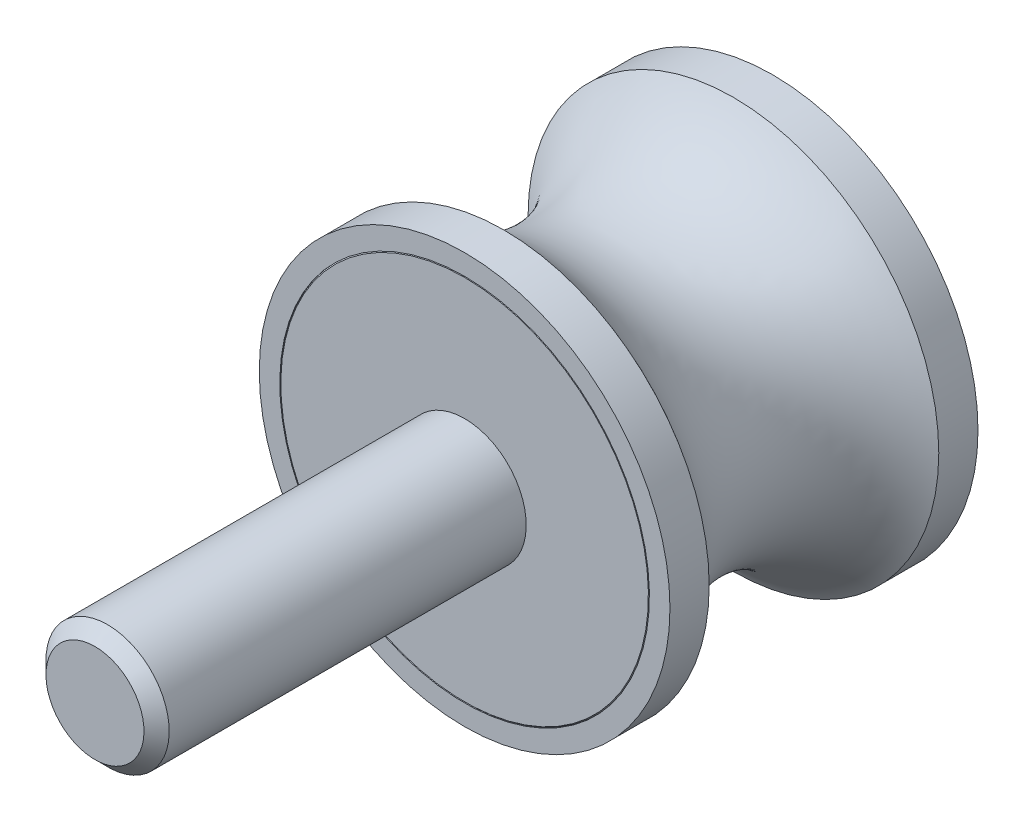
ISO-10303-21;
HEADER;
FILE_DESCRIPTION(('STEP AP214'),'2;1');
FILE_NAME('part.step','',(''),(''),'','','');
FILE_SCHEMA(('AUTOMOTIVE_DESIGN { 1 0 10303 214 1 1 1 1 }'));
ENDSEC;
DATA;
#1=APPLICATION_CONTEXT('core data for automotive mechanical design processes');
#2=APPLICATION_PROTOCOL_DEFINITION('international standard','automotive_design',2000,#1);
#3=PRODUCT_CONTEXT('',#1,'mechanical');
#4=PRODUCT('Part','Part','',(#3));
#5=PRODUCT_RELATED_PRODUCT_CATEGORY('part','',(#4));
#6=PRODUCT_DEFINITION_FORMATION('','',#4);
#7=PRODUCT_DEFINITION_CONTEXT('part definition',#1,'design');
#8=PRODUCT_DEFINITION('design','',#6,#7);
#9=PRODUCT_DEFINITION_SHAPE('','',#8);
#10=(LENGTH_UNIT() NAMED_UNIT(*) SI_UNIT(.MILLI.,.METRE.));
#11=(NAMED_UNIT(*) PLANE_ANGLE_UNIT() SI_UNIT($,.RADIAN.));
#12=(NAMED_UNIT(*) SI_UNIT($,.STERADIAN.) SOLID_ANGLE_UNIT());
#13=UNCERTAINTY_MEASURE_WITH_UNIT(LENGTH_MEASURE(1.E-05),#10,'distance_accuracy_value','');
#14=(GEOMETRIC_REPRESENTATION_CONTEXT(3) GLOBAL_UNCERTAINTY_ASSIGNED_CONTEXT((#13)) GLOBAL_UNIT_ASSIGNED_CONTEXT((#10,
#11,#12)) REPRESENTATION_CONTEXT('',''));
#15=CARTESIAN_POINT('',(0.,0.,0.));
#16=DIRECTION('',(0.,0.,1.));
#17=DIRECTION('',(1.,0.,0.));
#18=AXIS2_PLACEMENT_3D('',#15,#16,#17);
#19=CARTESIAN_POINT('',(0.,0.,0.5));
#20=DIRECTION('',(0.,0.,-1.));
#21=DIRECTION('',(0.,1.,0.));
#22=AXIS2_PLACEMENT_3D('',#19,#20,#21);
#23=CYLINDRICAL_SURFACE('',#22,9.);
#24=CARTESIAN_POINT('',(0.,0.,0.05));
#25=DIRECTION('',(0.,0.,-1.));
#26=DIRECTION('',(0.,1.,0.));
#27=AXIS2_PLACEMENT_3D('',#24,#25,#26);
#28=CIRCLE('',#27,9.);
#29=CARTESIAN_POINT('',(0.,9.,0.05));
#30=VERTEX_POINT('',#29);
#31=EDGE_CURVE('E53',#30,#30,#28,.T.);
#32=ORIENTED_EDGE('',*,*,#31,.F.);
#33=EDGE_LOOP('',(#32));
#34=FACE_BOUND('',#33,.T.);
#35=CARTESIAN_POINT('',(0.,0.,0.));
#36=DIRECTION('',(0.,0.,-1.));
#37=DIRECTION('',(0.,1.,0.));
#38=AXIS2_PLACEMENT_3D('',#35,#36,#37);
#39=CIRCLE('',#38,9.);
#40=CARTESIAN_POINT('',(0.,9.,0.));
#41=VERTEX_POINT('',#40);
#42=EDGE_CURVE('E44',#41,#41,#39,.T.);
#43=ORIENTED_EDGE('',*,*,#42,.T.);
#44=EDGE_LOOP('',(#43));
#45=FACE_BOUND('',#44,.T.);
#46=ADVANCED_FACE('F12',(#34,#45),#23,.F.);
#47=CARTESIAN_POINT('',(0.,0.,0.5));
#48=DIRECTION('',(0.,0.,-1.));
#49=DIRECTION('',(0.,1.,0.));
#50=AXIS2_PLACEMENT_3D('',#47,#48,#49);
#51=CYLINDRICAL_SURFACE('',#50,9.);
#52=CARTESIAN_POINT('',(0.,0.,15.));
#53=DIRECTION('',(0.,0.,-1.));
#54=DIRECTION('',(0.,1.,0.));
#55=AXIS2_PLACEMENT_3D('',#52,#53,#54);
#56=CIRCLE('',#55,9.);
#57=CARTESIAN_POINT('',(0.,9.,15.));
#58=VERTEX_POINT('',#57);
#59=EDGE_CURVE('E27',#58,#58,#56,.T.);
#60=ORIENTED_EDGE('',*,*,#59,.F.);
#61=EDGE_LOOP('',(#60));
#62=FACE_BOUND('',#61,.T.);
#63=CARTESIAN_POINT('',(0.,0.,14.95));
#64=DIRECTION('',(0.,0.,-1.));
#65=DIRECTION('',(0.,1.,0.));
#66=AXIS2_PLACEMENT_3D('',#63,#64,#65);
#67=CIRCLE('',#66,9.);
#68=CARTESIAN_POINT('',(0.,9.,14.95));
#69=VERTEX_POINT('',#68);
#70=EDGE_CURVE('E50',#69,#69,#67,.T.);
#71=ORIENTED_EDGE('',*,*,#70,.T.);
#72=EDGE_LOOP('',(#71));
#73=FACE_BOUND('',#72,.T.);
#74=ADVANCED_FACE('F89',(#62,#73),#51,.F.);
#75=CARTESIAN_POINT('',(9.,0.,15.));
#76=DIRECTION('',(0.,0.,-1.));
#77=DIRECTION('',(0.,1.,0.));
#78=AXIS2_PLACEMENT_3D('',#75,#76,#77);
#79=PLANE('',#78);
#80=CARTESIAN_POINT('',(0.,0.,15.));
#81=DIRECTION('',(0.,0.,-1.));
#82=DIRECTION('',(0.,1.,0.));
#83=AXIS2_PLACEMENT_3D('',#80,#81,#82);
#84=CIRCLE('',#83,10.);
#85=CARTESIAN_POINT('',(0.,10.,15.));
#86=VERTEX_POINT('',#85);
#87=EDGE_CURVE('E32',#86,#86,#84,.T.);
#88=ORIENTED_EDGE('',*,*,#87,.F.);
#89=EDGE_LOOP('',(#88));
#90=FACE_BOUND('',#89,.T.);
#91=ORIENTED_EDGE('',*,*,#59,.T.);
#92=EDGE_LOOP('',(#91));
#93=FACE_BOUND('',#92,.T.);
#94=ADVANCED_FACE('F115',(#90,#93),#79,.F.);
#95=CARTESIAN_POINT('',(0.,0.,0.5));
#96=DIRECTION('',(0.,0.,-1.));
#97=DIRECTION('',(0.,1.,0.));
#98=AXIS2_PLACEMENT_3D('',#95,#96,#97);
#99=CYLINDRICAL_SURFACE('',#98,10.);
#100=CARTESIAN_POINT('',(0.,0.,13.0901699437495));
#101=DIRECTION('',(0.,0.,-1.));
#102=DIRECTION('',(0.,1.,0.));
#103=AXIS2_PLACEMENT_3D('',#100,#101,#102);
#104=CIRCLE('',#103,10.);
#105=CARTESIAN_POINT('',(0.,10.,13.0901699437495));
#106=VERTEX_POINT('',#105);
#107=EDGE_CURVE('E35',#106,#106,#104,.T.);
#108=ORIENTED_EDGE('',*,*,#107,.F.);
#109=EDGE_LOOP('',(#108));
#110=FACE_BOUND('',#109,.T.);
#111=ORIENTED_EDGE('',*,*,#87,.T.);
#112=EDGE_LOOP('',(#111));
#113=FACE_BOUND('',#112,.T.);
#114=ADVANCED_FACE('F109',(#110,#113),#99,.T.);
#115=CARTESIAN_POINT('',(0.,0.,7.5));
#116=DIRECTION('',(0.,0.,-1.));
#117=DIRECTION('',(0.,1.,0.));
#118=AXIS2_PLACEMENT_3D('',#115,#116,#117);
#119=TOROIDAL_SURFACE('',#118,13.7083333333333,6.70833333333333);
#120=CARTESIAN_POINT('',(0.,0.,1.90983005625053));
#121=DIRECTION('',(0.,0.,-1.));
#122=DIRECTION('',(0.,1.,0.));
#123=AXIS2_PLACEMENT_3D('',#120,#121,#122);
#124=CIRCLE('',#123,10.);
#125=CARTESIAN_POINT('',(0.,10.,1.90983005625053));
#126=VERTEX_POINT('',#125);
#127=EDGE_CURVE('E38',#126,#126,#124,.T.);
#128=ORIENTED_EDGE('',*,*,#127,.F.);
#129=EDGE_LOOP('',(#128));
#130=FACE_BOUND('',#129,.T.);
#131=ORIENTED_EDGE('',*,*,#107,.T.);
#132=EDGE_LOOP('',(#131));
#133=FACE_BOUND('',#132,.T.);
#134=ADVANCED_FACE('F103',(#130,#133),#119,.F.);
#135=CARTESIAN_POINT('',(0.,0.,0.5));
#136=DIRECTION('',(0.,0.,-1.));
#137=DIRECTION('',(0.,1.,0.));
#138=AXIS2_PLACEMENT_3D('',#135,#136,#137);
#139=CYLINDRICAL_SURFACE('',#138,10.);
#140=CARTESIAN_POINT('',(0.,0.,0.));
#141=DIRECTION('',(0.,0.,-1.));
#142=DIRECTION('',(0.,1.,0.));
#143=AXIS2_PLACEMENT_3D('',#140,#141,#142);
#144=CIRCLE('',#143,10.);
#145=CARTESIAN_POINT('',(0.,10.,0.));
#146=VERTEX_POINT('',#145);
#147=EDGE_CURVE('E41',#146,#146,#144,.T.);
#148=ORIENTED_EDGE('',*,*,#147,.F.);
#149=EDGE_LOOP('',(#148));
#150=FACE_BOUND('',#149,.T.);
#151=ORIENTED_EDGE('',*,*,#127,.T.);
#152=EDGE_LOOP('',(#151));
#153=FACE_BOUND('',#152,.T.);
#154=ADVANCED_FACE('F97',(#150,#153),#139,.T.);
#155=CARTESIAN_POINT('',(10.,0.,0.));
#156=DIRECTION('',(0.,0.,1.));
#157=DIRECTION('',(0.,-1.,0.));
#158=AXIS2_PLACEMENT_3D('',#155,#156,#157);
#159=PLANE('',#158);
#160=ORIENTED_EDGE('',*,*,#42,.F.);
#161=EDGE_LOOP('',(#160));
#162=FACE_BOUND('',#161,.T.);
#163=ORIENTED_EDGE('',*,*,#147,.T.);
#164=EDGE_LOOP('',(#163));
#165=FACE_BOUND('',#164,.T.);
#166=ADVANCED_FACE('F93',(#162,#165),#159,.F.);
#167=CARTESIAN_POINT('',(0.,0.,15.));
#168=DIRECTION('',(0.,0.,-1.));
#169=DIRECTION('',(0.,1.,0.));
#170=AXIS2_PLACEMENT_3D('',#167,#168,#169);
#171=PLANE('',#170);
#172=CARTESIAN_POINT('',(0.,0.,15.));
#173=DIRECTION('',(0.,0.,-1.));
#174=DIRECTION('',(0.,1.,0.));
#175=AXIS2_PLACEMENT_3D('',#172,#173,#174);
#176=CIRCLE('',#175,8.95);
#177=CARTESIAN_POINT('',(0.,8.95,15.));
#178=VERTEX_POINT('',#177);
#179=EDGE_CURVE('E47',#178,#178,#176,.T.);
#180=ORIENTED_EDGE('',*,*,#179,.F.);
#181=EDGE_LOOP('',(#180));
#182=FACE_BOUND('',#181,.T.);
#183=CARTESIAN_POINT('',(0.,0.,15.));
#184=DIRECTION('',(0.,0.,-1.));
#185=DIRECTION('',(0.,1.,0.));
#186=AXIS2_PLACEMENT_3D('',#183,#184,#185);
#187=CIRCLE('',#186,3.);
#188=CARTESIAN_POINT('',(0.,3.,15.));
#189=VERTEX_POINT('',#188);
#190=EDGE_CURVE('E8',#189,#189,#187,.T.);
#191=ORIENTED_EDGE('',*,*,#190,.T.);
#192=EDGE_LOOP('',(#191));
#193=FACE_BOUND('',#192,.T.);
#194=ADVANCED_FACE('F96',(#182,#193),#171,.F.);
#195=CARTESIAN_POINT('',(0.,0.,15.));
#196=DIRECTION('',(0.,0.,-1.));
#197=DIRECTION('',(0.,1.,0.));
#198=AXIS2_PLACEMENT_3D('',#195,#196,#197);
#199=CONICAL_SURFACE('',#198,8.95,0.785398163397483);
#200=ORIENTED_EDGE('',*,*,#70,.F.);
#201=EDGE_LOOP('',(#200));
#202=FACE_BOUND('',#201,.T.);
#203=ORIENTED_EDGE('',*,*,#179,.T.);
#204=EDGE_LOOP('',(#203));
#205=FACE_BOUND('',#204,.T.);
#206=ADVANCED_FACE('F129',(#202,#205),#199,.T.);
#207=CARTESIAN_POINT('',(0.,0.,33.));
#208=DIRECTION('',(0.,0.,-1.));
#209=DIRECTION('',(0.,1.,0.));
#210=AXIS2_PLACEMENT_3D('',#207,#208,#209);
#211=PLANE('',#210);
#212=CARTESIAN_POINT('',(0.,0.,33.));
#213=DIRECTION('',(0.,0.,-1.));
#214=DIRECTION('',(0.,1.,0.));
#215=AXIS2_PLACEMENT_3D('',#212,#213,#214);
#216=CIRCLE('',#215,2.3865);
#217=CARTESIAN_POINT('',(0.,2.3865,33.));
#218=VERTEX_POINT('',#217);
#219=EDGE_CURVE('E19',#218,#218,#216,.T.);
#220=ORIENTED_EDGE('',*,*,#219,.F.);
#221=EDGE_LOOP('',(#220));
#222=FACE_BOUND('',#221,.T.);
#223=ADVANCED_FACE('F14',(#222),#211,.F.);
#224=CARTESIAN_POINT('',(0.,0.,33.));
#225=DIRECTION('',(0.,0.,-1.));
#226=DIRECTION('',(0.,1.,0.));
#227=AXIS2_PLACEMENT_3D('',#224,#225,#226);
#228=CONICAL_SURFACE('',#227,2.3865,0.785398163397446);
#229=CARTESIAN_POINT('',(0.,0.,32.3865));
#230=DIRECTION('',(0.,0.,-1.));
#231=DIRECTION('',(0.,1.,0.));
#232=AXIS2_PLACEMENT_3D('',#229,#230,#231);
#233=CIRCLE('',#232,3.);
#234=CARTESIAN_POINT('',(0.,3.,32.3865));
#235=VERTEX_POINT('',#234);
#236=EDGE_CURVE('E23',#235,#235,#233,.T.);
#237=ORIENTED_EDGE('',*,*,#236,.F.);
#238=EDGE_LOOP('',(#237));
#239=FACE_BOUND('',#238,.T.);
#240=ORIENTED_EDGE('',*,*,#219,.T.);
#241=EDGE_LOOP('',(#240));
#242=FACE_BOUND('',#241,.T.);
#243=ADVANCED_FACE('F142',(#239,#242),#228,.T.);
#244=CARTESIAN_POINT('',(0.,0.,0.5));
#245=DIRECTION('',(0.,0.,-1.));
#246=DIRECTION('',(0.,1.,0.));
#247=AXIS2_PLACEMENT_3D('',#244,#245,#246);
#248=CYLINDRICAL_SURFACE('',#247,3.);
#249=ORIENTED_EDGE('',*,*,#190,.F.);
#250=EDGE_LOOP('',(#249));
#251=FACE_BOUND('',#250,.T.);
#252=ORIENTED_EDGE('',*,*,#236,.T.);
#253=EDGE_LOOP('',(#252));
#254=FACE_BOUND('',#253,.T.);
#255=ADVANCED_FACE('F83',(#251,#254),#248,.T.);
#256=CARTESIAN_POINT('',(0.,0.,0.05));
#257=DIRECTION('',(0.,0.,1.));
#258=DIRECTION('',(0.,-1.,0.));
#259=AXIS2_PLACEMENT_3D('',#256,#257,#258);
#260=CONICAL_SURFACE('',#259,9.,0.785398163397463);
#261=CARTESIAN_POINT('',(0.,0.,0.));
#262=DIRECTION('',(0.,0.,-1.));
#263=DIRECTION('',(0.,1.,0.));
#264=AXIS2_PLACEMENT_3D('',#261,#262,#263);
#265=CIRCLE('',#264,8.95);
#266=CARTESIAN_POINT('',(0.,8.95,0.));
#267=VERTEX_POINT('',#266);
#268=EDGE_CURVE('E56',#267,#267,#265,.T.);
#269=ORIENTED_EDGE('',*,*,#268,.F.);
#270=EDGE_LOOP('',(#269));
#271=FACE_BOUND('',#270,.T.);
#272=ORIENTED_EDGE('',*,*,#31,.T.);
#273=EDGE_LOOP('',(#272));
#274=FACE_BOUND('',#273,.T.);
#275=ADVANCED_FACE('F77',(#271,#274),#260,.T.);
#276=CARTESIAN_POINT('',(8.95,0.,0.));
#277=DIRECTION('',(0.,0.,1.));
#278=DIRECTION('',(0.,-1.,0.));
#279=AXIS2_PLACEMENT_3D('',#276,#277,#278);
#280=PLANE('',#279);
#281=CARTESIAN_POINT('',(0.,0.,0.));
#282=DIRECTION('',(0.,0.,-1.));
#283=DIRECTION('',(-1.,0.,0.));
#284=AXIS2_PLACEMENT_3D('',#281,#282,#283);
#285=CIRCLE('',#284,3.);
#286=CARTESIAN_POINT('',(-3.,0.,0.));
#287=VERTEX_POINT('',#286);
#288=EDGE_CURVE('E60',#287,#287,#285,.T.);
#289=ORIENTED_EDGE('',*,*,#288,.F.);
#290=EDGE_LOOP('',(#289));
#291=FACE_BOUND('',#290,.T.);
#292=ORIENTED_EDGE('',*,*,#268,.T.);
#293=EDGE_LOOP('',(#292));
#294=FACE_BOUND('',#293,.T.);
#295=ADVANCED_FACE('F71',(#291,#294),#280,.F.);
#296=CARTESIAN_POINT('',(0.,0.,6.));
#297=DIRECTION('',(0.,0.,-1.));
#298=DIRECTION('',(-1.,0.,0.));
#299=AXIS2_PLACEMENT_3D('',#296,#297,#298);
#300=CYLINDRICAL_SURFACE('',#299,3.);
#301=CARTESIAN_POINT('',(0.,0.,6.));
#302=DIRECTION('',(0.,0.,-1.));
#303=DIRECTION('',(-1.,0.,0.));
#304=AXIS2_PLACEMENT_3D('',#301,#302,#303);
#305=CIRCLE('',#304,3.);
#306=CARTESIAN_POINT('',(-3.,0.,6.));
#307=VERTEX_POINT('',#306);
#308=EDGE_CURVE('E59',#307,#307,#305,.T.);
#309=ORIENTED_EDGE('',*,*,#308,.F.);
#310=EDGE_LOOP('',(#309));
#311=FACE_BOUND('',#310,.T.);
#312=ORIENTED_EDGE('',*,*,#288,.T.);
#313=EDGE_LOOP('',(#312));
#314=FACE_BOUND('',#313,.T.);
#315=ADVANCED_FACE('F68',(#311,#314),#300,.F.);
#316=CARTESIAN_POINT('',(0.,0.,6.));
#317=DIRECTION('',(0.,0.,-1.));
#318=DIRECTION('',(-1.,0.,0.));
#319=AXIS2_PLACEMENT_3D('',#316,#317,#318);
#320=PLANE('',#319);
#321=ORIENTED_EDGE('',*,*,#308,.T.);
#322=EDGE_LOOP('',(#321));
#323=FACE_BOUND('',#322,.T.);
#324=ADVANCED_FACE('F66',(#323),#320,.T.);
#325=CLOSED_SHELL('',(#46,#74,#94,#114,#134,#154,#166,#194,#206,#223,#243,#255,#275,#295,#315,#324));
#326=MANIFOLD_SOLID_BREP('B1',#325);
#327=ADVANCED_BREP_SHAPE_REPRESENTATION('',(#18,#326),#14);
#328=SHAPE_DEFINITION_REPRESENTATION(#9,#327);
ENDSEC;
END-ISO-10303-21;
